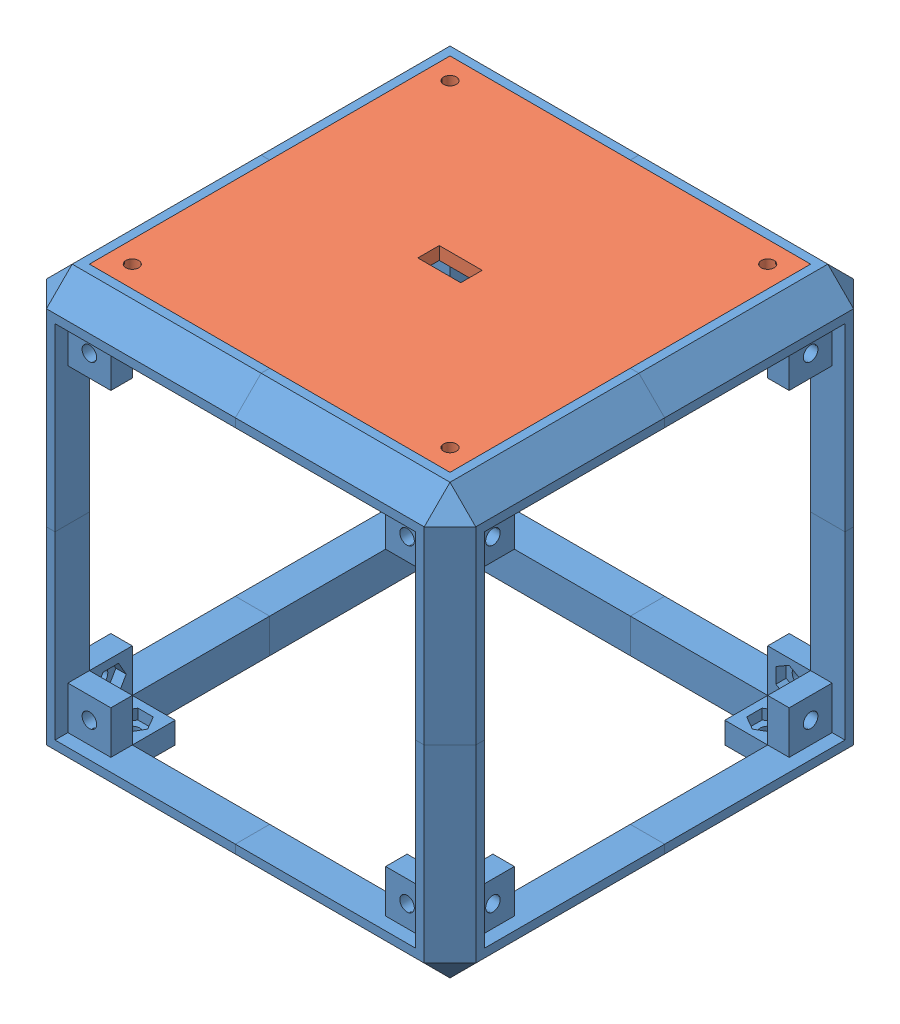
SolidWorks assembly Assem1.sldasm, configuration Default (file format 9000). Lengths in mm.
Overall size (100 100 100).
9 component instances, 2 part files, 24 mates.
Components (placement in the parent):
- angolo-1: angolo.SLDPRT [Default] at (-13.9437 -15.6826 25) size (50 50 50)
- angolo-2: angolo.SLDPRT [Default] at (70.0563 -15.6826 25) x (0 1 0) z (0 0 1) size (50 50 50)
- angolo-3: angolo.SLDPRT [Default] at (70.0563 68.3174 25) x (-1 0 0) z (0 0 1) size (50 50 50)
- angolo-5: angolo.SLDPRT [Default] at (-13.9437 68.3174 25) x (0 -1 0) z (0 0 1) size (50 50 50)
- angolo-7: angolo.SLDPRT [Default] at (-21.9437 68.3174 117) x (0 -1 0) z (1 0 0) size (50 50 50)
- angolo-9: angolo.SLDPRT [Default] at (-21.9437 -15.6826 117) x (0 0 -1) z (1 0 0) size (50 50 50)
- angolo-11: angolo.SLDPRT [Default] at (70.0563 -23.6826 117) x (0 0 -1) z (0 1 0) size (50 50 50)
- angolo-13: angolo.SLDPRT [Default] at (78.0563 68.3174 117) x (0 0 -1) z (-1 0 0) size (50 50 50)
- up-1: up.SLDPRT [Default] at (28.0563 73.3174 75) x (1 0 0) z (0 1 0) size (84 84 3)
Mates (geometry in assembly coordinates):
- Coincident1: coincident anti-aligned: plane of angolo-1 through (28.0563 -23.6826 33) normal (1 0 0); plane of angolo-2 through (28.0563 -15.6826 33) normal (-1 0 0)
- Coincident2: coincident aligned: plane of angolo-1 through (28.0563 -15.6826 33) normal (0 1 0); plane of angolo-2 through (70.0563 -15.6826 33) normal (0 1 0)
- Coincident3: coincident aligned: plane of angolo-1 through (-13.9437 -15.6826 33) normal (0 0 1); plane of angolo-2 through (70.0563 -15.6826 33) normal (0 0 1)
- Coincident4: coincident anti-aligned: plane of angolo-2 through (78.0563 26.3174 33) normal (0 1 0); plane of angolo-3 through (70.0563 26.3174 33) normal (0 -1 0)
- Coincident5: coincident aligned: plane of angolo-2 through (70.0563 26.3174 33) normal (-1 0 0); plane of angolo-3 through (70.0563 68.3174 33) normal (-1 0 0)
- Coincident6: coincident aligned: plane of angolo-2 through (70.0563 -15.6826 33) normal (0 0 1); plane of angolo-3 through (70.0563 68.3174 33) normal (0 0 1)
- Coincident7: coincident anti-aligned: plane of angolo-3 through (28.0563 76.3174 33) normal (-1 0 0); plane of angolo-5 through (28.0563 68.3174 33) normal (1 0 0)
- Coincident9: coincident aligned: plane of angolo-3 through (28.0563 68.3174 33) normal (0 -1 0); plane of angolo-5 through (-13.9437 68.3174 33) normal (0 -1 0)
- Coincident10: coincident aligned: plane of angolo-3 through (70.0563 68.3174 33) normal (0 0 1); plane of angolo-5 through (-13.9437 68.3174 33) normal (0 0 1)
- Coincident11: coincident anti-aligned: plane of angolo-5 through (-13.9437 68.3174 75) normal (0 0 1); plane of angolo-7 through (-13.9437 68.3174 75) normal (0 0 -1)
- Coincident12: coincident aligned: plane of angolo-5 through (-21.9437 68.3174 75) normal (0 -1 0); plane of angolo-7 through (-13.9437 68.3174 117) normal (0 -1 0)
- Coincident13: coincident aligned: plane of angolo-5 through (-13.9437 26.3174 33) normal (1 0 0); plane of angolo-7 through (-13.9437 68.3174 117) normal (1 0 0)
- Coincident14: coincident anti-aligned: plane of angolo-7 through (-13.9437 26.3174 125) normal (0 -1 0); plane of angolo-9 through (-13.9437 26.3174 117) normal (0 1 0)
- Coincident15: coincident aligned: plane of angolo-7 through (-13.9437 26.3174 117) normal (0 0 -1); plane of angolo-9 through (-13.9437 -15.6826 117) normal (0 0 -1)
- Coincident16: coincident aligned: plane of angolo-7 through (-13.9437 68.3174 117) normal (1 0 0); plane of angolo-9 through (-13.9437 -15.6826 117) normal (1 0 0)
- Coincident17: coincident anti-aligned: plane of angolo-9 through (28.0563 -15.6826 117) normal (1 0 0); plane of angolo-11 through (28.0563 -15.6826 117) normal (-1 0 0)
- Coincident18: coincident aligned: plane of angolo-9 through (28.0563 -23.6826 117) normal (0 0 -1); plane of angolo-11 through (70.0563 -15.6826 117) normal (0 0 -1)
- Coincident19: coincident aligned: plane of angolo-9 through (-13.9437 -15.6826 75) normal (0 1 0); plane of angolo-11 through (70.0563 -15.6826 117) normal (0 1 0)
- Coincident20: coincident anti-aligned: plane of angolo-11 through (70.0563 26.3174 117) normal (0 1 0); plane of angolo-13 through (70.0563 26.3174 117) normal (0 -1 0)
- Coincident21: coincident aligned: plane of angolo-11 through (78.0563 26.3174 117) normal (0 0 -1); plane of angolo-13 through (70.0563 68.3174 117) normal (0 0 -1)
- Coincident22: coincident aligned: plane of angolo-11 through (70.0563 -15.6826 75) normal (-1 0 0); plane of angolo-13 through (70.0563 68.3174 117) normal (-1 0 0)
- Coincident23: coincident anti-aligned: plane of angolo-13 through (60.0563 73.3174 107) normal (0 1 0); plane of up-1 through (28.0563 73.3174 75) normal (0 -1 0)
- Coincident24: coincident anti-aligned: plane of angolo-13 through (70.0563 68.3174 117) normal (-1 0 0); plane of up-1 through (70.0563 76.3174 33) normal (1 0 0)
- Coincident25: coincident anti-aligned: plane of angolo-5 through (-13.9437 68.3174 33) normal (0 0 1); plane of up-1 through (-13.9437 76.3174 33) normal (0 0 -1)
